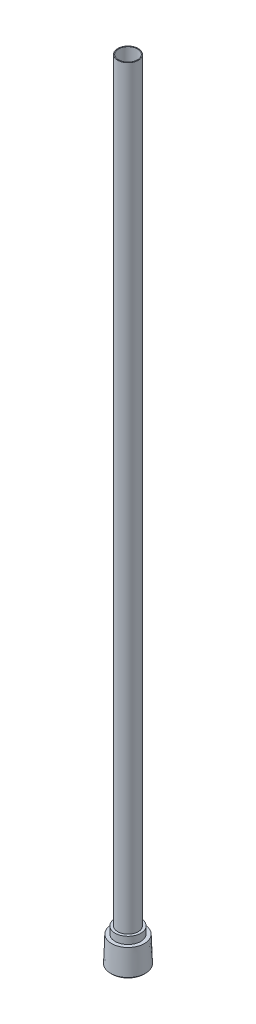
ISO-10303-21;
HEADER;
FILE_DESCRIPTION(('STEP AP214'),'2;1');
FILE_NAME('part.step','',(''),(''),'','','');
FILE_SCHEMA(('AUTOMOTIVE_DESIGN { 1 0 10303 214 1 1 1 1 }'));
ENDSEC;
DATA;
#1=APPLICATION_CONTEXT('core data for automotive mechanical design processes');
#2=APPLICATION_PROTOCOL_DEFINITION('international standard','automotive_design',2000,#1);
#3=PRODUCT_CONTEXT('',#1,'mechanical');
#4=PRODUCT('Part','Part','',(#3));
#5=PRODUCT_RELATED_PRODUCT_CATEGORY('part','',(#4));
#6=PRODUCT_DEFINITION_FORMATION('','',#4);
#7=PRODUCT_DEFINITION_CONTEXT('part definition',#1,'design');
#8=PRODUCT_DEFINITION('design','',#6,#7);
#9=PRODUCT_DEFINITION_SHAPE('','',#8);
#10=(LENGTH_UNIT() NAMED_UNIT(*) SI_UNIT(.MILLI.,.METRE.));
#11=(NAMED_UNIT(*) PLANE_ANGLE_UNIT() SI_UNIT($,.RADIAN.));
#12=(NAMED_UNIT(*) SI_UNIT($,.STERADIAN.) SOLID_ANGLE_UNIT());
#13=UNCERTAINTY_MEASURE_WITH_UNIT(LENGTH_MEASURE(1.E-05),#10,'distance_accuracy_value','');
#14=(GEOMETRIC_REPRESENTATION_CONTEXT(3) GLOBAL_UNCERTAINTY_ASSIGNED_CONTEXT((#13)) GLOBAL_UNIT_ASSIGNED_CONTEXT((#10,
#11,#12)) REPRESENTATION_CONTEXT('',''));
#15=CARTESIAN_POINT('',(0.,0.,0.));
#16=DIRECTION('',(0.,0.,1.));
#17=DIRECTION('',(1.,0.,0.));
#18=AXIS2_PLACEMENT_3D('',#15,#16,#17);
#19=CARTESIAN_POINT('',(0.,7.92480000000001,3.6661742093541));
#20=DIRECTION('',(0.,-1.,0.));
#21=DIRECTION('',(0.,0.,-1.));
#22=AXIS2_PLACEMENT_3D('',#19,#20,#21);
#23=PLANE('',#22);
#24=DIRECTION('',(0.866025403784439,0.,-0.5));
#25=VECTOR('',#24,1.);
#26=CARTESIAN_POINT('',(-3.175,7.92479999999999,-1.83308710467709));
#27=LINE('',#26,#25);
#28=CARTESIAN_POINT('',(-3.175,7.92479999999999,-1.83308710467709));
#29=VERTEX_POINT('',#28);
#30=CARTESIAN_POINT('',(-3.16009644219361,7.92479999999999,-1.84169167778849));
#31=VERTEX_POINT('',#30);
#32=EDGE_CURVE('E143',#29,#31,#27,.T.);
#33=ORIENTED_EDGE('',*,*,#32,.T.);
#34=CARTESIAN_POINT('',(0.,7.9248,0.));
#35=DIRECTION('',(0.,-1.,0.));
#36=DIRECTION('',(0.,0.,-1.));
#37=AXIS2_PLACEMENT_3D('',#34,#35,#36);
#38=CIRCLE('',#37,3.6576);
#39=CARTESIAN_POINT('',(-3.175,7.92479999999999,-1.81587795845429));
#40=VERTEX_POINT('',#39);
#41=EDGE_CURVE('E124',#31,#40,#38,.F.);
#42=ORIENTED_EDGE('',*,*,#41,.T.);
#43=DIRECTION('',(0.,0.,-1.));
#44=VECTOR('',#43,1.);
#45=CARTESIAN_POINT('',(-3.175,7.92480000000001,1.83308710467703));
#46=LINE('',#45,#44);
#47=EDGE_CURVE('E147',#40,#29,#46,.T.);
#48=ORIENTED_EDGE('',*,*,#47,.T.);
#49=EDGE_LOOP('',(#33,#42,#48));
#50=FACE_BOUND('',#49,.T.);
#51=ADVANCED_FACE('F34',(#50),#23,.T.);
#52=CARTESIAN_POINT('',(-3.175,7.92480000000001,1.83308710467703));
#53=VERTEX_POINT('',#52);
#54=CARTESIAN_POINT('',(-3.175,7.92480000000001,1.81587795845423));
#55=VERTEX_POINT('',#54);
#56=EDGE_CURVE('E154',#53,#55,#46,.T.);
#57=ORIENTED_EDGE('',*,*,#56,.T.);
#58=CARTESIAN_POINT('',(-3.16009644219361,7.92480000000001,1.84169167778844));
#59=VERTEX_POINT('',#58);
#60=EDGE_CURVE('E523',#55,#59,#38,.F.);
#61=ORIENTED_EDGE('',*,*,#60,.T.);
#62=DIRECTION('',(-0.866025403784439,0.,-0.5));
#63=VECTOR('',#62,1.);
#64=CARTESIAN_POINT('',(0.,7.92480000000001,3.6661742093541));
#65=LINE('',#64,#63);
#66=EDGE_CURVE('E166',#59,#53,#65,.T.);
#67=ORIENTED_EDGE('',*,*,#66,.T.);
#68=EDGE_LOOP('',(#57,#61,#67));
#69=FACE_BOUND('',#68,.T.);
#70=ADVANCED_FACE('F236',(#69),#23,.T.);
#71=CARTESIAN_POINT('',(0.,7.92480000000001,3.6661742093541));
#72=VERTEX_POINT('',#71);
#73=CARTESIAN_POINT('',(-0.0149035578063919,7.92480000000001,3.65756963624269));
#74=VERTEX_POINT('',#73);
#75=EDGE_CURVE('E163',#72,#74,#65,.T.);
#76=ORIENTED_EDGE('',*,*,#75,.T.);
#77=CARTESIAN_POINT('',(0.0149035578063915,7.92480000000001,3.65756963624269));
#78=VERTEX_POINT('',#77);
#79=EDGE_CURVE('E520',#74,#78,#38,.F.);
#80=ORIENTED_EDGE('',*,*,#79,.T.);
#81=DIRECTION('',(-0.866025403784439,0.,0.5));
#82=VECTOR('',#81,1.);
#83=CARTESIAN_POINT('',(3.175,7.92480000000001,1.83308710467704));
#84=LINE('',#83,#82);
#85=EDGE_CURVE('E176',#78,#72,#84,.T.);
#86=ORIENTED_EDGE('',*,*,#85,.T.);
#87=EDGE_LOOP('',(#76,#80,#86));
#88=FACE_BOUND('',#87,.T.);
#89=ADVANCED_FACE('F242',(#88),#23,.T.);
#90=CARTESIAN_POINT('',(3.175,7.92480000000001,1.83308710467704));
#91=VERTEX_POINT('',#90);
#92=CARTESIAN_POINT('',(3.16009644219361,7.92480000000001,1.84169167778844));
#93=VERTEX_POINT('',#92);
#94=EDGE_CURVE('E171',#91,#93,#84,.T.);
#95=ORIENTED_EDGE('',*,*,#94,.T.);
#96=CARTESIAN_POINT('',(3.175,7.92480000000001,1.81587795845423));
#97=VERTEX_POINT('',#96);
#98=EDGE_CURVE('E288',#93,#97,#38,.F.);
#99=ORIENTED_EDGE('',*,*,#98,.T.);
#100=DIRECTION('',(0.,0.,1.));
#101=VECTOR('',#100,1.);
#102=CARTESIAN_POINT('',(3.175,7.92479999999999,-1.83308710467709));
#103=LINE('',#102,#101);
#104=EDGE_CURVE('E258',#97,#91,#103,.T.);
#105=ORIENTED_EDGE('',*,*,#104,.T.);
#106=EDGE_LOOP('',(#95,#99,#105));
#107=FACE_BOUND('',#106,.T.);
#108=ADVANCED_FACE('F253',(#107),#23,.T.);
#109=CARTESIAN_POINT('',(3.175,7.92479999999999,-1.83308710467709));
#110=VERTEX_POINT('',#109);
#111=CARTESIAN_POINT('',(3.175,7.92479999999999,-1.81587795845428));
#112=VERTEX_POINT('',#111);
#113=EDGE_CURVE('E206',#110,#112,#103,.T.);
#114=ORIENTED_EDGE('',*,*,#113,.T.);
#115=CARTESIAN_POINT('',(3.16009644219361,7.92479999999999,-1.84169167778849));
#116=VERTEX_POINT('',#115);
#117=EDGE_CURVE('E282',#112,#116,#38,.F.);
#118=ORIENTED_EDGE('',*,*,#117,.T.);
#119=DIRECTION('',(0.866025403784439,0.,0.5));
#120=VECTOR('',#119,1.);
#121=CARTESIAN_POINT('',(0.,7.92479999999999,-3.66617420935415));
#122=LINE('',#121,#120);
#123=EDGE_CURVE('E149',#116,#110,#122,.T.);
#124=ORIENTED_EDGE('',*,*,#123,.T.);
#125=EDGE_LOOP('',(#114,#118,#124));
#126=FACE_BOUND('',#125,.T.);
#127=ADVANCED_FACE('F247',(#126),#23,.T.);
#128=CARTESIAN_POINT('',(0.,7.92479999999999,-3.66617420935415));
#129=VERTEX_POINT('',#128);
#130=CARTESIAN_POINT('',(0.0149035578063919,7.92479999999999,-3.65756963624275));
#131=VERTEX_POINT('',#130);
#132=EDGE_CURVE('E152',#129,#131,#122,.T.);
#133=ORIENTED_EDGE('',*,*,#132,.T.);
#134=CARTESIAN_POINT('',(-0.0149035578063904,7.92479999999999,-3.65756963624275));
#135=VERTEX_POINT('',#134);
#136=EDGE_CURVE('E137',#131,#135,#38,.F.);
#137=ORIENTED_EDGE('',*,*,#136,.T.);
#138=EDGE_CURVE('E145',#135,#129,#27,.T.);
#139=ORIENTED_EDGE('',*,*,#138,.T.);
#140=EDGE_LOOP('',(#133,#137,#139));
#141=FACE_BOUND('',#140,.T.);
#142=ADVANCED_FACE('F238',(#141),#23,.T.);
#143=CARTESIAN_POINT('',(0.,0.,0.));
#144=DIRECTION('',(0.,1.,0.));
#145=DIRECTION('',(0.,0.,1.));
#146=AXIS2_PLACEMENT_3D('',#143,#144,#145);
#147=PLANE('',#146);
#148=CARTESIAN_POINT('',(0.,0.,0.));
#149=DIRECTION('',(0.,1.,0.));
#150=DIRECTION('',(0.,0.,1.));
#151=AXIS2_PLACEMENT_3D('',#148,#149,#150);
#152=CIRCLE('',#151,6.21029999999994);
#153=CARTESIAN_POINT('',(0.,0.,6.21029999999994));
#154=VERTEX_POINT('',#153);
#155=EDGE_CURVE('E11',#154,#154,#152,.F.);
#156=ORIENTED_EDGE('',*,*,#155,.T.);
#157=EDGE_LOOP('',(#156));
#158=FACE_BOUND('',#157,.T.);
#159=DIRECTION('',(-0.866025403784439,0.,-0.5));
#160=VECTOR('',#159,1.);
#161=CARTESIAN_POINT('',(0.,0.,3.66617420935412));
#162=LINE('',#161,#160);
#163=CARTESIAN_POINT('',(0.,0.,3.66617420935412));
#164=VERTEX_POINT('',#163);
#165=CARTESIAN_POINT('',(-3.175,0.,1.83308710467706));
#166=VERTEX_POINT('',#165);
#167=EDGE_CURVE('E264',#164,#166,#162,.T.);
#168=ORIENTED_EDGE('',*,*,#167,.F.);
#169=DIRECTION('',(-0.866025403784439,0.,0.5));
#170=VECTOR('',#169,1.);
#171=CARTESIAN_POINT('',(3.175,0.,1.83308710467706));
#172=LINE('',#171,#170);
#173=CARTESIAN_POINT('',(3.175,0.,1.83308710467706));
#174=VERTEX_POINT('',#173);
#175=EDGE_CURVE('E58',#174,#164,#172,.T.);
#176=ORIENTED_EDGE('',*,*,#175,.F.);
#177=DIRECTION('',(0.,0.,1.));
#178=VECTOR('',#177,1.);
#179=CARTESIAN_POINT('',(3.175,0.,-1.83308710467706));
#180=LINE('',#179,#178);
#181=CARTESIAN_POINT('',(3.175,0.,-1.83308710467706));
#182=VERTEX_POINT('',#181);
#183=EDGE_CURVE('E180',#182,#174,#180,.T.);
#184=ORIENTED_EDGE('',*,*,#183,.F.);
#185=DIRECTION('',(0.866025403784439,0.,0.5));
#186=VECTOR('',#185,1.);
#187=CARTESIAN_POINT('',(0.,0.,-3.66617420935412));
#188=LINE('',#187,#186);
#189=CARTESIAN_POINT('',(0.,0.,-3.66617420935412));
#190=VERTEX_POINT('',#189);
#191=EDGE_CURVE('E183',#190,#182,#188,.T.);
#192=ORIENTED_EDGE('',*,*,#191,.F.);
#193=DIRECTION('',(0.866025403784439,0.,-0.5));
#194=VECTOR('',#193,1.);
#195=CARTESIAN_POINT('',(-3.175,0.,-1.83308710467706));
#196=LINE('',#195,#194);
#197=CARTESIAN_POINT('',(-3.175,0.,-1.83308710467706));
#198=VERTEX_POINT('',#197);
#199=EDGE_CURVE('E189',#198,#190,#196,.T.);
#200=ORIENTED_EDGE('',*,*,#199,.F.);
#201=DIRECTION('',(0.,0.,-1.));
#202=VECTOR('',#201,1.);
#203=CARTESIAN_POINT('',(-3.175,0.,1.83308710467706));
#204=LINE('',#203,#202);
#205=EDGE_CURVE('E267',#166,#198,#204,.T.);
#206=ORIENTED_EDGE('',*,*,#205,.F.);
#207=EDGE_LOOP('',(#168,#176,#184,#192,#200,#206));
#208=FACE_BOUND('',#207,.T.);
#209=ADVANCED_FACE('F246',(#158,#208),#147,.F.);
#210=CARTESIAN_POINT('',(0.,0.,0.));
#211=DIRECTION('',(0.,-1.,0.));
#212=DIRECTION('',(0.,0.,-1.));
#213=AXIS2_PLACEMENT_3D('',#210,#211,#212);
#214=CONICAL_SURFACE('',#213,6.7183,0.0364424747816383);
#215=CARTESIAN_POINT('',(0.,0.490130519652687,0.));
#216=DIRECTION('',(0.,1.,0.));
#217=DIRECTION('',(0.,0.,1.));
#218=AXIS2_PLACEMENT_3D('',#215,#216,#217);
#219=CIRCLE('',#218,6.70043051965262);
#220=CARTESIAN_POINT('',(0.,0.490130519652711,6.70043051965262));
#221=VERTEX_POINT('',#220);
#222=EDGE_CURVE('E43',#221,#221,#219,.T.);
#223=ORIENTED_EDGE('',*,*,#222,.T.);
#224=EDGE_LOOP('',(#223));
#225=FACE_BOUND('',#224,.T.);
#226=CARTESIAN_POINT('',(0.,10.3124,0.));
#227=DIRECTION('',(0.,1.,0.));
#228=DIRECTION('',(0.,0.,1.));
#229=AXIS2_PLACEMENT_3D('',#226,#227,#228);
#230=CIRCLE('',#229,6.34232416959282);
#231=CARTESIAN_POINT('',(0.,10.3124,6.34232416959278));
#232=VERTEX_POINT('',#231);
#233=EDGE_CURVE('E218',#232,#232,#230,.T.);
#234=ORIENTED_EDGE('',*,*,#233,.F.);
#235=EDGE_LOOP('',(#234));
#236=FACE_BOUND('',#235,.T.);
#237=ADVANCED_FACE('F223',(#225,#236),#214,.T.);
#238=CARTESIAN_POINT('',(0.,10.3124,-6.34232416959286));
#239=DIRECTION('',(0.,-1.,0.));
#240=DIRECTION('',(0.,0.,-1.));
#241=AXIS2_PLACEMENT_3D('',#238,#239,#240);
#242=PLANE('',#241);
#243=CARTESIAN_POINT('',(0.,10.3124,0.));
#244=DIRECTION('',(0.,1.,0.));
#245=DIRECTION('',(0.,0.,1.));
#246=AXIS2_PLACEMENT_3D('',#243,#244,#245);
#247=CIRCLE('',#246,4.95299999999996);
#248=CARTESIAN_POINT('',(0.,10.3124,4.95299999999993));
#249=VERTEX_POINT('',#248);
#250=EDGE_CURVE('E215',#249,#249,#247,.T.);
#251=ORIENTED_EDGE('',*,*,#250,.F.);
#252=EDGE_LOOP('',(#251));
#253=FACE_BOUND('',#252,.T.);
#254=ORIENTED_EDGE('',*,*,#233,.T.);
#255=EDGE_LOOP('',(#254));
#256=FACE_BOUND('',#255,.T.);
#257=ADVANCED_FACE('F317',(#253,#256),#242,.F.);
#258=CARTESIAN_POINT('',(0.,0.,0.));
#259=DIRECTION('',(0.,1.,0.));
#260=DIRECTION('',(0.,0.,1.));
#261=AXIS2_PLACEMENT_3D('',#258,#259,#260);
#262=CYLINDRICAL_SURFACE('',#261,4.95299999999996);
#263=CARTESIAN_POINT('',(0.,13.081,0.));
#264=DIRECTION('',(0.,1.,0.));
#265=DIRECTION('',(0.,0.,1.));
#266=AXIS2_PLACEMENT_3D('',#263,#264,#265);
#267=CIRCLE('',#266,4.95299999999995);
#268=CARTESIAN_POINT('',(0.,13.081,4.95299999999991));
#269=VERTEX_POINT('',#268);
#270=EDGE_CURVE('E212',#269,#269,#267,.T.);
#271=ORIENTED_EDGE('',*,*,#270,.F.);
#272=EDGE_LOOP('',(#271));
#273=FACE_BOUND('',#272,.T.);
#274=ORIENTED_EDGE('',*,*,#250,.T.);
#275=EDGE_LOOP('',(#274));
#276=FACE_BOUND('',#275,.T.);
#277=ADVANCED_FACE('F311',(#273,#276),#262,.T.);
#278=CARTESIAN_POINT('',(0.,13.081,-4.953));
#279=DIRECTION('',(0.,-1.,0.));
#280=DIRECTION('',(0.,0.,-1.));
#281=AXIS2_PLACEMENT_3D('',#278,#279,#280);
#282=PLANE('',#281);
#283=CARTESIAN_POINT('',(0.,13.081,0.));
#284=DIRECTION('',(0.,1.,0.));
#285=DIRECTION('',(0.,0.,1.));
#286=AXIS2_PLACEMENT_3D('',#283,#284,#285);
#287=CIRCLE('',#286,3.96239999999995);
#288=CARTESIAN_POINT('',(0.,13.081,3.96239999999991));
#289=VERTEX_POINT('',#288);
#290=EDGE_CURVE('E209',#289,#289,#287,.T.);
#291=ORIENTED_EDGE('',*,*,#290,.F.);
#292=EDGE_LOOP('',(#291));
#293=FACE_BOUND('',#292,.T.);
#294=ORIENTED_EDGE('',*,*,#270,.T.);
#295=EDGE_LOOP('',(#294));
#296=FACE_BOUND('',#295,.T.);
#297=ADVANCED_FACE('F305',(#293,#296),#282,.F.);
#298=CARTESIAN_POINT('',(0.,0.,0.));
#299=DIRECTION('',(0.,1.,0.));
#300=DIRECTION('',(0.,0.,1.));
#301=AXIS2_PLACEMENT_3D('',#298,#299,#300);
#302=CYLINDRICAL_SURFACE('',#301,3.96239999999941);
#303=CARTESIAN_POINT('',(0.,304.8,-1.06420362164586E-12));
#304=DIRECTION('',(0.,1.,0.));
#305=DIRECTION('',(0.,0.,1.));
#306=AXIS2_PLACEMENT_3D('',#303,#304,#305);
#307=CIRCLE('',#306,3.96239999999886);
#308=CARTESIAN_POINT('',(0.,304.8,3.9623999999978));
#309=VERTEX_POINT('',#308);
#310=EDGE_CURVE('E195',#309,#309,#307,.T.);
#311=ORIENTED_EDGE('',*,*,#310,.F.);
#312=EDGE_LOOP('',(#311));
#313=FACE_BOUND('',#312,.T.);
#314=ORIENTED_EDGE('',*,*,#290,.T.);
#315=EDGE_LOOP('',(#314));
#316=FACE_BOUND('',#315,.T.);
#317=ADVANCED_FACE('F299',(#313,#316),#302,.T.);
#318=CARTESIAN_POINT('',(0.,304.8,-3.96239999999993));
#319=DIRECTION('',(0.,-1.,0.));
#320=DIRECTION('',(0.,0.,-1.));
#321=AXIS2_PLACEMENT_3D('',#318,#319,#320);
#322=PLANE('',#321);
#323=CARTESIAN_POINT('',(0.,304.8,-1.06420362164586E-12));
#324=DIRECTION('',(0.,1.,0.));
#325=DIRECTION('',(0.,0.,1.));
#326=AXIS2_PLACEMENT_3D('',#323,#324,#325);
#327=CIRCLE('',#326,3.6576);
#328=CARTESIAN_POINT('',(0.,304.8,3.65759999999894));
#329=VERTEX_POINT('',#328);
#330=EDGE_CURVE('E291',#329,#329,#327,.T.);
#331=ORIENTED_EDGE('',*,*,#330,.F.);
#332=EDGE_LOOP('',(#331));
#333=FACE_BOUND('',#332,.T.);
#334=ORIENTED_EDGE('',*,*,#310,.T.);
#335=EDGE_LOOP('',(#334));
#336=FACE_BOUND('',#335,.T.);
#337=ADVANCED_FACE('F295',(#333,#336),#322,.F.);
#338=CARTESIAN_POINT('',(3.175,7.92480000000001,1.83308710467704));
#339=DIRECTION('',(0.5,0.,0.866025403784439));
#340=DIRECTION('',(0.866025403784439,0.,-0.5));
#341=AXIS2_PLACEMENT_3D('',#338,#339,#340);
#342=PLANE('',#341);
#343=ORIENTED_EDGE('',*,*,#175,.T.);
#344=DIRECTION('',(0.,-1.,0.));
#345=VECTOR('',#344,1.);
#346=CARTESIAN_POINT('',(0.,7.92480000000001,3.6661742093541));
#347=LINE('',#346,#345);
#348=EDGE_CURVE('E204',#72,#164,#347,.T.);
#349=ORIENTED_EDGE('',*,*,#348,.F.);
#350=ORIENTED_EDGE('',*,*,#85,.F.);
#351=EDGE_CURVE('E175',#93,#78,#84,.T.);
#352=ORIENTED_EDGE('',*,*,#351,.F.);
#353=ORIENTED_EDGE('',*,*,#94,.F.);
#354=DIRECTION('',(0.,-1.,0.));
#355=VECTOR('',#354,1.);
#356=CARTESIAN_POINT('',(3.175,7.92480000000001,1.83308710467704));
#357=LINE('',#356,#355);
#358=EDGE_CURVE('E193',#91,#174,#357,.T.);
#359=ORIENTED_EDGE('',*,*,#358,.T.);
#360=EDGE_LOOP('',(#343,#349,#350,#352,#353,#359));
#361=FACE_BOUND('',#360,.T.);
#362=ADVANCED_FACE('F298',(#361),#342,.F.);
#363=CARTESIAN_POINT('',(3.175,7.92479999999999,-1.83308710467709));
#364=DIRECTION('',(1.,0.,0.));
#365=DIRECTION('',(0.,0.,-1.));
#366=AXIS2_PLACEMENT_3D('',#363,#364,#365);
#367=PLANE('',#366);
#368=ORIENTED_EDGE('',*,*,#183,.T.);
#369=ORIENTED_EDGE('',*,*,#358,.F.);
#370=ORIENTED_EDGE('',*,*,#104,.F.);
#371=EDGE_CURVE('E259',#112,#97,#103,.T.);
#372=ORIENTED_EDGE('',*,*,#371,.F.);
#373=ORIENTED_EDGE('',*,*,#113,.F.);
#374=DIRECTION('',(0.,-1.,0.));
#375=VECTOR('',#374,1.);
#376=CARTESIAN_POINT('',(3.175,7.92479999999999,-1.83308710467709));
#377=LINE('',#376,#375);
#378=EDGE_CURVE('E196',#110,#182,#377,.T.);
#379=ORIENTED_EDGE('',*,*,#378,.T.);
#380=EDGE_LOOP('',(#368,#369,#370,#372,#373,#379));
#381=FACE_BOUND('',#380,.T.);
#382=ADVANCED_FACE('F279',(#381),#367,.F.);
#383=CARTESIAN_POINT('',(0.,7.92479999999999,-3.66617420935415));
#384=DIRECTION('',(0.5,0.,-0.866025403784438));
#385=DIRECTION('',(-0.866025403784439,0.,-0.5));
#386=AXIS2_PLACEMENT_3D('',#383,#384,#385);
#387=PLANE('',#386);
#388=ORIENTED_EDGE('',*,*,#191,.T.);
#389=ORIENTED_EDGE('',*,*,#378,.F.);
#390=ORIENTED_EDGE('',*,*,#123,.F.);
#391=EDGE_CURVE('E150',#131,#116,#122,.T.);
#392=ORIENTED_EDGE('',*,*,#391,.F.);
#393=ORIENTED_EDGE('',*,*,#132,.F.);
#394=DIRECTION('',(0.,-1.,0.));
#395=VECTOR('',#394,1.);
#396=CARTESIAN_POINT('',(0.,7.92479999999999,-3.66617420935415));
#397=LINE('',#396,#395);
#398=EDGE_CURVE('E198',#129,#190,#397,.T.);
#399=ORIENTED_EDGE('',*,*,#398,.T.);
#400=EDGE_LOOP('',(#388,#389,#390,#392,#393,#399));
#401=FACE_BOUND('',#400,.T.);
#402=ADVANCED_FACE('F275',(#401),#387,.F.);
#403=CARTESIAN_POINT('',(-3.175,7.92479999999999,-1.83308710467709));
#404=DIRECTION('',(-0.5,0.,-0.866025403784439));
#405=DIRECTION('',(-0.866025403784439,0.,0.5));
#406=AXIS2_PLACEMENT_3D('',#403,#404,#405);
#407=PLANE('',#406);
#408=ORIENTED_EDGE('',*,*,#199,.T.);
#409=ORIENTED_EDGE('',*,*,#398,.F.);
#410=ORIENTED_EDGE('',*,*,#138,.F.);
#411=EDGE_CURVE('E135',#31,#135,#27,.T.);
#412=ORIENTED_EDGE('',*,*,#411,.F.);
#413=ORIENTED_EDGE('',*,*,#32,.F.);
#414=DIRECTION('',(0.,-1.,0.));
#415=VECTOR('',#414,1.);
#416=CARTESIAN_POINT('',(-3.175,7.92479999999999,-1.83308710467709));
#417=LINE('',#416,#415);
#418=EDGE_CURVE('E200',#29,#198,#417,.T.);
#419=ORIENTED_EDGE('',*,*,#418,.T.);
#420=EDGE_LOOP('',(#408,#409,#410,#412,#413,#419));
#421=FACE_BOUND('',#420,.T.);
#422=ADVANCED_FACE('F142',(#421),#407,.F.);
#423=CARTESIAN_POINT('',(-3.175,7.92480000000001,1.83308710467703));
#424=DIRECTION('',(-1.,0.,0.));
#425=DIRECTION('',(0.,0.,1.));
#426=AXIS2_PLACEMENT_3D('',#423,#424,#425);
#427=PLANE('',#426);
#428=ORIENTED_EDGE('',*,*,#205,.T.);
#429=ORIENTED_EDGE('',*,*,#418,.F.);
#430=ORIENTED_EDGE('',*,*,#47,.F.);
#431=EDGE_CURVE('E158',#55,#40,#46,.T.);
#432=ORIENTED_EDGE('',*,*,#431,.F.);
#433=ORIENTED_EDGE('',*,*,#56,.F.);
#434=DIRECTION('',(0.,-1.,0.));
#435=VECTOR('',#434,1.);
#436=CARTESIAN_POINT('',(-3.175,7.92480000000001,1.83308710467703));
#437=LINE('',#436,#435);
#438=EDGE_CURVE('E202',#53,#166,#437,.T.);
#439=ORIENTED_EDGE('',*,*,#438,.T.);
#440=EDGE_LOOP('',(#428,#429,#430,#432,#433,#439));
#441=FACE_BOUND('',#440,.T.);
#442=ADVANCED_FACE('F336',(#441),#427,.F.);
#443=CARTESIAN_POINT('',(0.,7.92480000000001,3.6661742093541));
#444=DIRECTION('',(-0.5,0.,0.866025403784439));
#445=DIRECTION('',(0.866025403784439,0.,0.5));
#446=AXIS2_PLACEMENT_3D('',#443,#444,#445);
#447=PLANE('',#446);
#448=ORIENTED_EDGE('',*,*,#167,.T.);
#449=ORIENTED_EDGE('',*,*,#438,.F.);
#450=ORIENTED_EDGE('',*,*,#66,.F.);
#451=EDGE_CURVE('E165',#74,#59,#65,.T.);
#452=ORIENTED_EDGE('',*,*,#451,.F.);
#453=ORIENTED_EDGE('',*,*,#75,.F.);
#454=ORIENTED_EDGE('',*,*,#348,.T.);
#455=EDGE_LOOP('',(#448,#449,#450,#452,#453,#454));
#456=FACE_BOUND('',#455,.T.);
#457=ADVANCED_FACE('F332',(#456),#447,.F.);
#458=CARTESIAN_POINT('',(0.,7.92480000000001,3.6661742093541));
#459=DIRECTION('',(0.,-1.,0.));
#460=DIRECTION('',(0.,0.,-1.));
#461=AXIS2_PLACEMENT_3D('',#458,#459,#460);
#462=PLANE('',#461);
#463=ORIENTED_EDGE('',*,*,#351,.T.);
#464=EDGE_CURVE('E517',#78,#93,#38,.F.);
#465=ORIENTED_EDGE('',*,*,#464,.T.);
#466=EDGE_LOOP('',(#463,#465));
#467=FACE_BOUND('',#466,.T.);
#468=ADVANCED_FACE('F335',(#467),#462,.F.);
#469=ORIENTED_EDGE('',*,*,#451,.T.);
#470=EDGE_CURVE('E522',#59,#74,#38,.F.);
#471=ORIENTED_EDGE('',*,*,#470,.T.);
#472=EDGE_LOOP('',(#469,#471));
#473=FACE_BOUND('',#472,.T.);
#474=ADVANCED_FACE('F371',(#473),#462,.F.);
#475=ORIENTED_EDGE('',*,*,#431,.T.);
#476=EDGE_CURVE('E127',#40,#55,#38,.F.);
#477=ORIENTED_EDGE('',*,*,#476,.T.);
#478=EDGE_LOOP('',(#475,#477));
#479=FACE_BOUND('',#478,.T.);
#480=ADVANCED_FACE('F378',(#479),#462,.F.);
#481=ORIENTED_EDGE('',*,*,#411,.T.);
#482=EDGE_CURVE('E50',#135,#31,#38,.F.);
#483=ORIENTED_EDGE('',*,*,#482,.T.);
#484=EDGE_LOOP('',(#481,#483));
#485=FACE_BOUND('',#484,.T.);
#486=ADVANCED_FACE('F134',(#485),#462,.F.);
#487=ORIENTED_EDGE('',*,*,#391,.T.);
#488=EDGE_CURVE('E287',#116,#131,#38,.F.);
#489=ORIENTED_EDGE('',*,*,#488,.T.);
#490=EDGE_LOOP('',(#487,#489));
#491=FACE_BOUND('',#490,.T.);
#492=ADVANCED_FACE('F391',(#491),#462,.F.);
#493=ORIENTED_EDGE('',*,*,#371,.T.);
#494=EDGE_CURVE('E286',#97,#112,#38,.F.);
#495=ORIENTED_EDGE('',*,*,#494,.T.);
#496=EDGE_LOOP('',(#493,#495));
#497=FACE_BOUND('',#496,.T.);
#498=ADVANCED_FACE('F231',(#497),#462,.F.);
#499=CARTESIAN_POINT('',(0.,-2.42045505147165,0.));
#500=DIRECTION('',(0.,1.,0.));
#501=DIRECTION('',(0.,0.,1.));
#502=AXIS2_PLACEMENT_3D('',#499,#500,#501);
#503=CYLINDRICAL_SURFACE('',#502,3.6576);
#504=ORIENTED_EDGE('',*,*,#330,.T.);
#505=EDGE_LOOP('',(#504));
#506=FACE_BOUND('',#505,.T.);
#507=ORIENTED_EDGE('',*,*,#482,.F.);
#508=ORIENTED_EDGE('',*,*,#136,.F.);
#509=ORIENTED_EDGE('',*,*,#488,.F.);
#510=ORIENTED_EDGE('',*,*,#117,.F.);
#511=ORIENTED_EDGE('',*,*,#494,.F.);
#512=ORIENTED_EDGE('',*,*,#98,.F.);
#513=ORIENTED_EDGE('',*,*,#464,.F.);
#514=ORIENTED_EDGE('',*,*,#79,.F.);
#515=ORIENTED_EDGE('',*,*,#470,.F.);
#516=ORIENTED_EDGE('',*,*,#60,.F.);
#517=ORIENTED_EDGE('',*,*,#476,.F.);
#518=ORIENTED_EDGE('',*,*,#41,.F.);
#519=EDGE_LOOP('',(#507,#508,#509,#510,#511,#512,#513,#514,#515,#516,#517,#518));
#520=FACE_BOUND('',#519,.T.);
#521=ADVANCED_FACE('F125',(#506,#520),#503,.F.);
#522=CARTESIAN_POINT('',(0.,0.490130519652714,0.));
#523=DIRECTION('',(0.,1.,0.));
#524=DIRECTION('',(0.,0.,1.));
#525=AXIS2_PLACEMENT_3D('',#522,#523,#524);
#526=CONICAL_SURFACE('',#525,6.70043051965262,0.785398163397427);
#527=ORIENTED_EDGE('',*,*,#155,.F.);
#528=EDGE_LOOP('',(#527));
#529=FACE_BOUND('',#528,.T.);
#530=ORIENTED_EDGE('',*,*,#222,.F.);
#531=EDGE_LOOP('',(#530));
#532=FACE_BOUND('',#531,.T.);
#533=ADVANCED_FACE('F37',(#529,#532),#526,.T.);
#534=CLOSED_SHELL('',(#51,#70,#89,#108,#127,#142,#209,#237,#257,#277,#297,#317,#337,#362,#382,
#402,#422,#442,#457,#468,#474,#480,#486,#492,#498,#521,#533));
#535=MANIFOLD_SOLID_BREP('B2',#534);
#536=ADVANCED_BREP_SHAPE_REPRESENTATION('',(#18,#535),#14);
#537=SHAPE_DEFINITION_REPRESENTATION(#9,#536);
ENDSEC;
END-ISO-10303-21;
